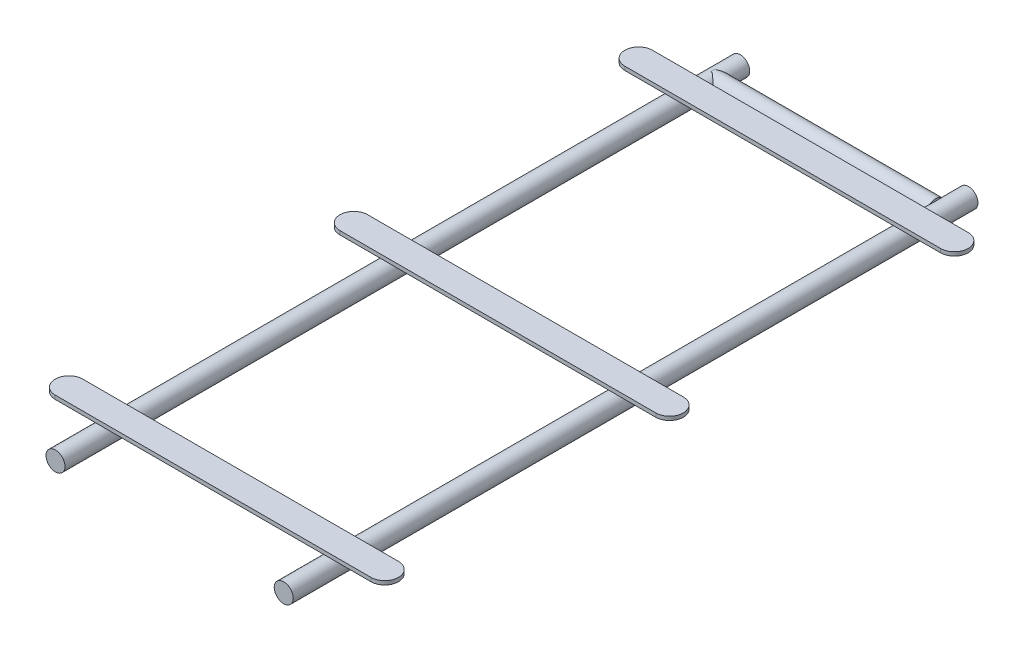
from build123d import *

# Parameters (mm, degrees)
SKETCH1_R             = 2.5
BOSS_EXTRUDE1_DEPTH   = 180
BOSS_EXTRUDE1_2_DEPTH = 180
BOSS_EXTRUDE3_DEPTH   = 1
BOSS_EXTRUDE3_2_DEPTH = 1
BOSS_EXTRUDE3_3_DEPTH = 1
SKETCH7_R             = 2.5
BOSS_EXTRUDE4_DEPTH   = 58.5


with BuildPart() as part:
    # Sketch1 → Boss-Extrude1 (new body)
    with BuildSketch(Plane.XY):
        Circle(SKETCH1_R)
    extrude(amount=-BOSS_EXTRUDE1_DEPTH)


with BuildPart() as body_2:
    # Sketch1 → Boss-Extrude1 2 (new body)
    with BuildSketch(Plane.XY):
        with Locations((60, 0)):
            Circle(SKETCH1_R)
    extrude(amount=-BOSS_EXTRUDE1_2_DEPTH)


with BuildPart() as body_3:
    # Sketch6 → Boss-Extrude3 (new body)
    with BuildSketch(Plane(origin=(0, 2.5, 0), x_dir=(1, 0, 0), z_dir=(0, 1, 0))):
        with BuildLine():
            Line((-11.556283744, 18.730491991), (71.443716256, 18.730491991))
            ThreePointArc((71.443716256, 18.730491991), (75.071496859, 15.102711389), (71.443716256, 11.474930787))
            Line((71.443716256, 11.474930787), (-11.556283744, 11.474930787))
            ThreePointArc((-11.556283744, 11.474930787), (-15.184064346, 15.102711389), (-11.556283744, 18.730491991))
        make_face()
    extrude(amount=BOSS_EXTRUDE3_DEPTH)


with BuildPart() as body_4:
    # Sketch6 → Boss-Extrude3 2 (new body)
    with BuildSketch(Plane(origin=(0, 2.5, 0), x_dir=(1, 0, 0), z_dir=(0, 1, 0))):
        with BuildLine():
            Line((-11.556283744, 93.602711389), (71.443716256, 93.602711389))
            ThreePointArc((71.443716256, 93.602711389), (75.071496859, 89.974930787), (71.443716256, 86.347150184))
            Line((71.443716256, 86.347150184), (-11.556283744, 86.347150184))
            ThreePointArc((-11.556283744, 86.347150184), (-15.184064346, 89.974930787), (-11.556283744, 93.602711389))
        make_face()
    extrude(amount=BOSS_EXTRUDE3_2_DEPTH)


with BuildPart() as body_5:
    # Sketch6 → Boss-Extrude3 3 (new body)
    with BuildSketch(Plane(origin=(0, 2.5, 0), x_dir=(1, 0, 0), z_dir=(0, 1, 0))):
        with BuildLine():
            Line((-11.556283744, 168.474930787), (71.443716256, 168.474930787))
            ThreePointArc((71.443716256, 168.474930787), (75.071496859, 164.847150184), (71.443716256, 161.219369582))
            Line((71.443716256, 161.219369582), (-11.556283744, 161.219369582))
            ThreePointArc((-11.556283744, 161.219369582), (-15.184064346, 164.847150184), (-11.556283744, 168.474930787))
        make_face()
    extrude(amount=BOSS_EXTRUDE3_3_DEPTH)


with BuildPart() as body_6:
    # Sketch7 → Boss-Extrude4 (new body)
    with BuildSketch(Plane(origin=(0, 0, 0), x_dir=(0, 0, -1), z_dir=(1, 0, 0))):
        with Locations(Location((172.859862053, 0.06025461, 0), (0, 0, 180))):
            Circle(SKETCH7_R)
    extrude(amount=BOSS_EXTRUDE4_DEPTH)


solid = Compound([part.part, body_2.part, body_3.part, body_4.part, body_5.part, body_6.part])
